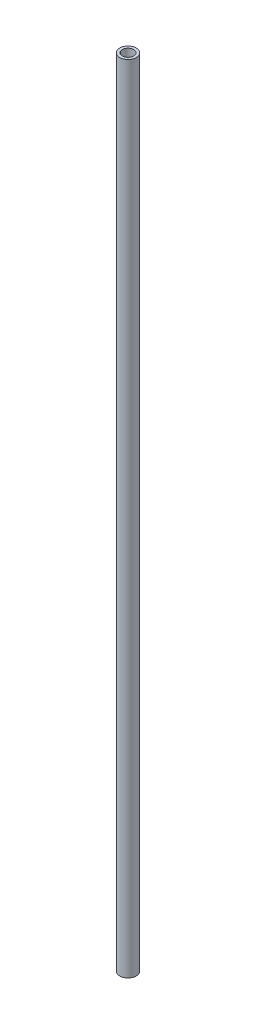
from build123d import *

# Parameters (mm, degrees)
SKETCH1_R           = 3.175
SKETCH1_R_2         = 2.159
BOSS_EXTRUDE1_DEPTH = 304.8


with BuildPart() as part:
    # Sketch1 → Boss-Extrude1 (new body)
    with BuildSketch(Plane(origin=(0, 0, 0), x_dir=(1, 0, 0), z_dir=(0, 1, 0))):
        with Locations(Location((0, 0, 0), (0, 0, 90))):
            Circle(SKETCH1_R)
        with Locations(Location((0, 0, 0), (0, 0, 90))):
            Circle(SKETCH1_R_2, mode=Mode.SUBTRACT)
    extrude(amount=BOSS_EXTRUDE1_DEPTH)


solid = part.part
